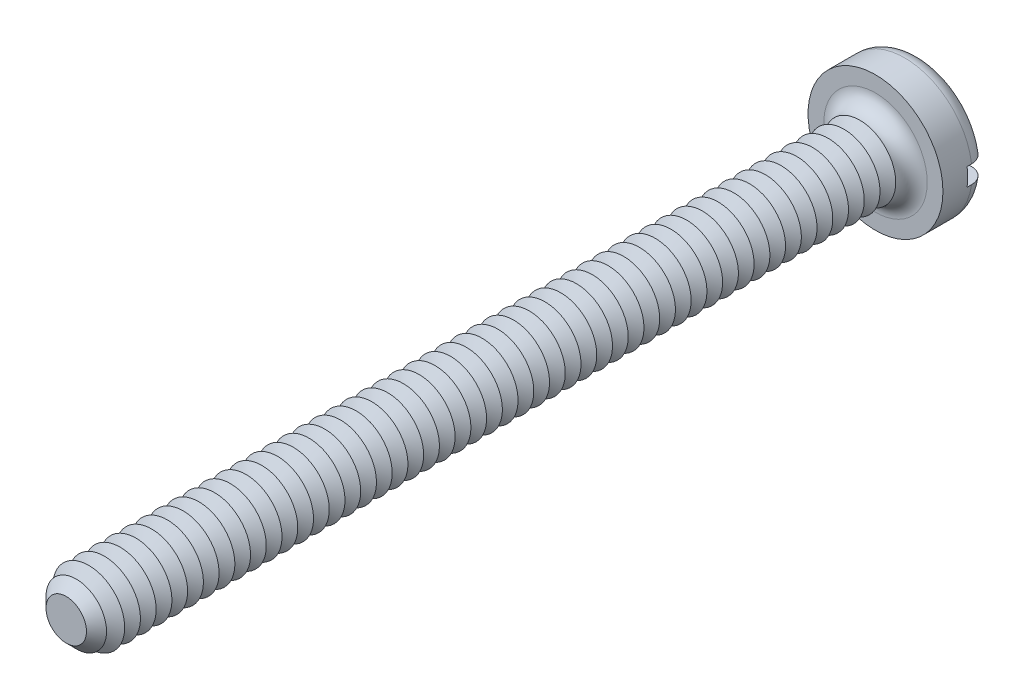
from build123d import *

# Parameters (mm, degrees)
SKETCH3_R           = 1.5
BOSS_EXTRUDE2_DEPTH = 1
SKETCH4_R           = 0.8
BOSS_EXTRUDE3_DEPTH = 18
FILLET1_R           = 0.35
CHAMFER1_SIZE       = 0.35
LPATTERN1_COUNT     = 50
LPATTERN1_PITCH     = 0.35
SKETCH8_W           = 3
SKETCH8_H           = 0.4
CUT_EXTRUDE1_DEPTH  = 0.45


with BuildPart() as part:
    # Sketch3 → Boss-Extrude2 (new body)
    with BuildSketch(Plane.XY):
        Circle(SKETCH3_R)
    extrude(amount=-BOSS_EXTRUDE2_DEPTH)

    # Sketch4 → Boss-Extrude3 (add)
    with BuildSketch(Plane.XY):
        Circle(SKETCH4_R)
    extrude(amount=BOSS_EXTRUDE3_DEPTH)

    # Fillet1
    fillet1_edges = [part.edges().sort_by_distance(p)[0] for p in [
        (-1.5, 0, -1),
        (-0.8, 0, 0),
    ]]
    fillet(fillet1_edges, radius=FILLET1_R)

    # Chamfer1
    chamfer1_edges = [part.edges().sort_by_distance(p)[0] for p in [
        (-0.8, 0, 18),
    ]]
    chamfer(chamfer1_edges, length=CHAMFER1_SIZE)

    # Sketch6 → Cut-Revolve1 (revolve, cut)
    with BuildSketch(Plane(origin=(0, 0, 0), x_dir=(0, 0, -1), z_dir=(1, 0, 0)), mode=Mode.PRIVATE) as cut_revolve1_sk:
        Polygon((-0.35, 0.8), (-0.525, 0.496891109), (-0.7, 0.8), align=None)
    cut_revolve1 = revolve(cut_revolve1_sk.sketch.rotate(Axis((0, 0, -1.694361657), (0, 0, 1)), 90), axis=Axis((0, 0, -1.694361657), (0, 0, 1)), mode=Mode.SUBTRACT)

    # LPattern1: Cut-Revolve1 ×50
    with Locations(*[(0, 0, i * LPATTERN1_PITCH) for i in range(1, LPATTERN1_COUNT)]):
        add(cut_revolve1, mode=Mode.SUBTRACT)

    # Sketch8 → Cut-Extrude1 (cut)
    with BuildSketch(Plane(origin=(0, 0, -1), x_dir=(-1, 0, 0), z_dir=(0, 0, -1))):
        Rectangle(SKETCH8_W, SKETCH8_H)
    extrude(amount=-CUT_EXTRUDE1_DEPTH, mode=Mode.SUBTRACT)


solid = part.part
